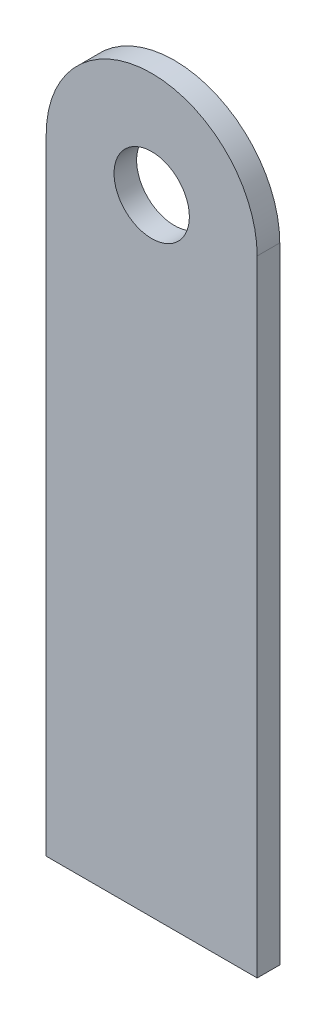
ISO-10303-21;
HEADER;
FILE_DESCRIPTION(('STEP AP214'),'2;1');
FILE_NAME('part.step','',(''),(''),'','','');
FILE_SCHEMA(('AUTOMOTIVE_DESIGN { 1 0 10303 214 1 1 1 1 }'));
ENDSEC;
DATA;
#1=APPLICATION_CONTEXT('core data for automotive mechanical design processes');
#2=APPLICATION_PROTOCOL_DEFINITION('international standard','automotive_design',2000,#1);
#3=PRODUCT_CONTEXT('',#1,'mechanical');
#4=PRODUCT('Part','Part','',(#3));
#5=PRODUCT_RELATED_PRODUCT_CATEGORY('part','',(#4));
#6=PRODUCT_DEFINITION_FORMATION('','',#4);
#7=PRODUCT_DEFINITION_CONTEXT('part definition',#1,'design');
#8=PRODUCT_DEFINITION('design','',#6,#7);
#9=PRODUCT_DEFINITION_SHAPE('','',#8);
#10=(LENGTH_UNIT() NAMED_UNIT(*) SI_UNIT(.MILLI.,.METRE.));
#11=(NAMED_UNIT(*) PLANE_ANGLE_UNIT() SI_UNIT($,.RADIAN.));
#12=(NAMED_UNIT(*) SI_UNIT($,.STERADIAN.) SOLID_ANGLE_UNIT());
#13=UNCERTAINTY_MEASURE_WITH_UNIT(LENGTH_MEASURE(1.E-05),#10,'distance_accuracy_value','');
#14=(GEOMETRIC_REPRESENTATION_CONTEXT(3) GLOBAL_UNCERTAINTY_ASSIGNED_CONTEXT((#13)) GLOBAL_UNIT_ASSIGNED_CONTEXT((#10,
#11,#12)) REPRESENTATION_CONTEXT('',''));
#15=CARTESIAN_POINT('',(0.,0.,0.));
#16=DIRECTION('',(0.,0.,1.));
#17=DIRECTION('',(1.,0.,0.));
#18=AXIS2_PLACEMENT_3D('',#15,#16,#17);
#19=CARTESIAN_POINT('',(1.4,8.3,0.3));
#20=DIRECTION('',(0.,0.,1.));
#21=DIRECTION('',(1.,0.,0.));
#22=AXIS2_PLACEMENT_3D('',#19,#20,#21);
#23=PLANE('',#22);
#24=DIRECTION('',(0.,-1.,0.));
#25=VECTOR('',#24,1.);
#26=CARTESIAN_POINT('',(0.,8.3,0.3));
#27=LINE('',#26,#25);
#28=CARTESIAN_POINT('',(0.,8.3,0.3));
#29=VERTEX_POINT('',#28);
#30=CARTESIAN_POINT('',(0.,0.,0.3));
#31=VERTEX_POINT('',#30);
#32=EDGE_CURVE('E86',#29,#31,#27,.T.);
#33=ORIENTED_EDGE('',*,*,#32,.T.);
#34=DIRECTION('',(1.,0.,0.));
#35=VECTOR('',#34,1.);
#36=CARTESIAN_POINT('',(0.,0.,0.3));
#37=LINE('',#36,#35);
#38=CARTESIAN_POINT('',(2.8,0.,0.3));
#39=VERTEX_POINT('',#38);
#40=EDGE_CURVE('E81',#31,#39,#37,.T.);
#41=ORIENTED_EDGE('',*,*,#40,.T.);
#42=DIRECTION('',(0.,1.,0.));
#43=VECTOR('',#42,1.);
#44=CARTESIAN_POINT('',(2.8,0.,0.3));
#45=LINE('',#44,#43);
#46=CARTESIAN_POINT('',(2.8,8.3,0.3));
#47=VERTEX_POINT('',#46);
#48=EDGE_CURVE('E84',#39,#47,#45,.T.);
#49=ORIENTED_EDGE('',*,*,#48,.T.);
#50=CARTESIAN_POINT('',(1.4,8.3,0.3));
#51=DIRECTION('',(0.,0.,1.));
#52=DIRECTION('',(1.,0.,0.));
#53=AXIS2_PLACEMENT_3D('',#50,#51,#52);
#54=CIRCLE('',#53,1.4);
#55=EDGE_CURVE('E51',#47,#29,#54,.T.);
#56=ORIENTED_EDGE('',*,*,#55,.T.);
#57=EDGE_LOOP('',(#33,#41,#49,#56));
#58=FACE_BOUND('',#57,.T.);
#59=CARTESIAN_POINT('',(1.4,8.3,0.3));
#60=DIRECTION('',(0.,0.,1.));
#61=DIRECTION('',(1.,0.,0.));
#62=AXIS2_PLACEMENT_3D('',#59,#60,#61);
#63=CIRCLE('',#62,0.5);
#64=CARTESIAN_POINT('',(1.9,8.3,0.3));
#65=VERTEX_POINT('',#64);
#66=EDGE_CURVE('E101',#65,#65,#63,.T.);
#67=ORIENTED_EDGE('',*,*,#66,.F.);
#68=EDGE_LOOP('',(#67));
#69=FACE_BOUND('',#68,.T.);
#70=ADVANCED_FACE('F34',(#58,#69),#23,.T.);
#71=CARTESIAN_POINT('',(1.4,8.3,0.));
#72=DIRECTION('',(0.,0.,1.));
#73=DIRECTION('',(1.,0.,0.));
#74=AXIS2_PLACEMENT_3D('',#71,#72,#73);
#75=PLANE('',#74);
#76=DIRECTION('',(0.,-1.,0.));
#77=VECTOR('',#76,1.);
#78=CARTESIAN_POINT('',(0.,8.3,0.));
#79=LINE('',#78,#77);
#80=CARTESIAN_POINT('',(0.,8.3,0.));
#81=VERTEX_POINT('',#80);
#82=CARTESIAN_POINT('',(0.,0.,0.));
#83=VERTEX_POINT('',#82);
#84=EDGE_CURVE('E98',#81,#83,#79,.T.);
#85=ORIENTED_EDGE('',*,*,#84,.F.);
#86=CARTESIAN_POINT('',(1.4,8.3,0.));
#87=DIRECTION('',(0.,0.,1.));
#88=DIRECTION('',(1.,0.,0.));
#89=AXIS2_PLACEMENT_3D('',#86,#87,#88);
#90=CIRCLE('',#89,1.4);
#91=CARTESIAN_POINT('',(2.8,8.3,0.));
#92=VERTEX_POINT('',#91);
#93=EDGE_CURVE('E74',#92,#81,#90,.T.);
#94=ORIENTED_EDGE('',*,*,#93,.F.);
#95=DIRECTION('',(0.,1.,0.));
#96=VECTOR('',#95,1.);
#97=CARTESIAN_POINT('',(2.8,0.,0.));
#98=LINE('',#97,#96);
#99=CARTESIAN_POINT('',(2.8,0.,0.));
#100=VERTEX_POINT('',#99);
#101=EDGE_CURVE('E68',#100,#92,#98,.T.);
#102=ORIENTED_EDGE('',*,*,#101,.F.);
#103=DIRECTION('',(1.,0.,0.));
#104=VECTOR('',#103,1.);
#105=CARTESIAN_POINT('',(0.,0.,0.));
#106=LINE('',#105,#104);
#107=EDGE_CURVE('E90',#83,#100,#106,.T.);
#108=ORIENTED_EDGE('',*,*,#107,.F.);
#109=EDGE_LOOP('',(#85,#94,#102,#108));
#110=FACE_BOUND('',#109,.T.);
#111=CARTESIAN_POINT('',(1.4,8.3,0.));
#112=DIRECTION('',(0.,0.,1.));
#113=DIRECTION('',(1.,0.,0.));
#114=AXIS2_PLACEMENT_3D('',#111,#112,#113);
#115=CIRCLE('',#114,0.5);
#116=CARTESIAN_POINT('',(1.9,8.3,0.));
#117=VERTEX_POINT('',#116);
#118=EDGE_CURVE('E113',#117,#117,#115,.T.);
#119=ORIENTED_EDGE('',*,*,#118,.T.);
#120=EDGE_LOOP('',(#119));
#121=FACE_BOUND('',#120,.T.);
#122=ADVANCED_FACE('F109',(#110,#121),#75,.F.);
#123=CARTESIAN_POINT('',(0.,8.3,0.3));
#124=DIRECTION('',(1.,0.,0.));
#125=DIRECTION('',(0.,0.,-1.));
#126=AXIS2_PLACEMENT_3D('',#123,#124,#125);
#127=PLANE('',#126);
#128=ORIENTED_EDGE('',*,*,#84,.T.);
#129=DIRECTION('',(0.,0.,-1.));
#130=VECTOR('',#129,1.);
#131=CARTESIAN_POINT('',(0.,0.,0.3));
#132=LINE('',#131,#130);
#133=EDGE_CURVE('E11',#31,#83,#132,.T.);
#134=ORIENTED_EDGE('',*,*,#133,.F.);
#135=ORIENTED_EDGE('',*,*,#32,.F.);
#136=DIRECTION('',(0.,0.,-1.));
#137=VECTOR('',#136,1.);
#138=CARTESIAN_POINT('',(0.,8.3,0.3));
#139=LINE('',#138,#137);
#140=EDGE_CURVE('E94',#29,#81,#139,.T.);
#141=ORIENTED_EDGE('',*,*,#140,.T.);
#142=EDGE_LOOP('',(#128,#134,#135,#141));
#143=FACE_BOUND('',#142,.T.);
#144=ADVANCED_FACE('F36',(#143),#127,.F.);
#145=CARTESIAN_POINT('',(0.,0.,0.3));
#146=DIRECTION('',(0.,1.,0.));
#147=DIRECTION('',(0.,0.,1.));
#148=AXIS2_PLACEMENT_3D('',#145,#146,#147);
#149=PLANE('',#148);
#150=ORIENTED_EDGE('',*,*,#107,.T.);
#151=DIRECTION('',(0.,0.,-1.));
#152=VECTOR('',#151,1.);
#153=CARTESIAN_POINT('',(2.8,0.,0.3));
#154=LINE('',#153,#152);
#155=EDGE_CURVE('E43',#39,#100,#154,.T.);
#156=ORIENTED_EDGE('',*,*,#155,.F.);
#157=ORIENTED_EDGE('',*,*,#40,.F.);
#158=ORIENTED_EDGE('',*,*,#133,.T.);
#159=EDGE_LOOP('',(#150,#156,#157,#158));
#160=FACE_BOUND('',#159,.T.);
#161=ADVANCED_FACE('F89',(#160),#149,.F.);
#162=CARTESIAN_POINT('',(2.8,0.,0.3));
#163=DIRECTION('',(-1.,0.,0.));
#164=DIRECTION('',(0.,-1.,0.));
#165=AXIS2_PLACEMENT_3D('',#162,#163,#164);
#166=PLANE('',#165);
#167=ORIENTED_EDGE('',*,*,#101,.T.);
#168=DIRECTION('',(0.,0.,-1.));
#169=VECTOR('',#168,1.);
#170=CARTESIAN_POINT('',(2.8,8.3,0.3));
#171=LINE('',#170,#169);
#172=EDGE_CURVE('E91',#47,#92,#171,.T.);
#173=ORIENTED_EDGE('',*,*,#172,.F.);
#174=ORIENTED_EDGE('',*,*,#48,.F.);
#175=ORIENTED_EDGE('',*,*,#155,.T.);
#176=EDGE_LOOP('',(#167,#173,#174,#175));
#177=FACE_BOUND('',#176,.T.);
#178=ADVANCED_FACE('F92',(#177),#166,.F.);
#179=CARTESIAN_POINT('',(1.4,8.3,0.3));
#180=DIRECTION('',(0.,0.,-1.));
#181=DIRECTION('',(-1.,0.,0.));
#182=AXIS2_PLACEMENT_3D('',#179,#180,#181);
#183=CYLINDRICAL_SURFACE('',#182,1.4);
#184=ORIENTED_EDGE('',*,*,#93,.T.);
#185=ORIENTED_EDGE('',*,*,#140,.F.);
#186=ORIENTED_EDGE('',*,*,#55,.F.);
#187=ORIENTED_EDGE('',*,*,#172,.T.);
#188=EDGE_LOOP('',(#184,#185,#186,#187));
#189=FACE_BOUND('',#188,.T.);
#190=ADVANCED_FACE('F106',(#189),#183,.T.);
#191=CARTESIAN_POINT('',(1.4,8.3,0.3));
#192=DIRECTION('',(0.,0.,-1.));
#193=DIRECTION('',(-1.,0.,0.));
#194=AXIS2_PLACEMENT_3D('',#191,#192,#193);
#195=CYLINDRICAL_SURFACE('',#194,0.5);
#196=ORIENTED_EDGE('',*,*,#66,.T.);
#197=EDGE_LOOP('',(#196));
#198=FACE_BOUND('',#197,.T.);
#199=ORIENTED_EDGE('',*,*,#118,.F.);
#200=EDGE_LOOP('',(#199));
#201=FACE_BOUND('',#200,.T.);
#202=ADVANCED_FACE('F119',(#198,#201),#195,.F.);
#203=CLOSED_SHELL('',(#70,#122,#144,#161,#178,#190,#202));
#204=MANIFOLD_SOLID_BREP('B2',#203);
#205=ADVANCED_BREP_SHAPE_REPRESENTATION('',(#18,#204),#14);
#206=SHAPE_DEFINITION_REPRESENTATION(#9,#205);
ENDSEC;
END-ISO-10303-21;
